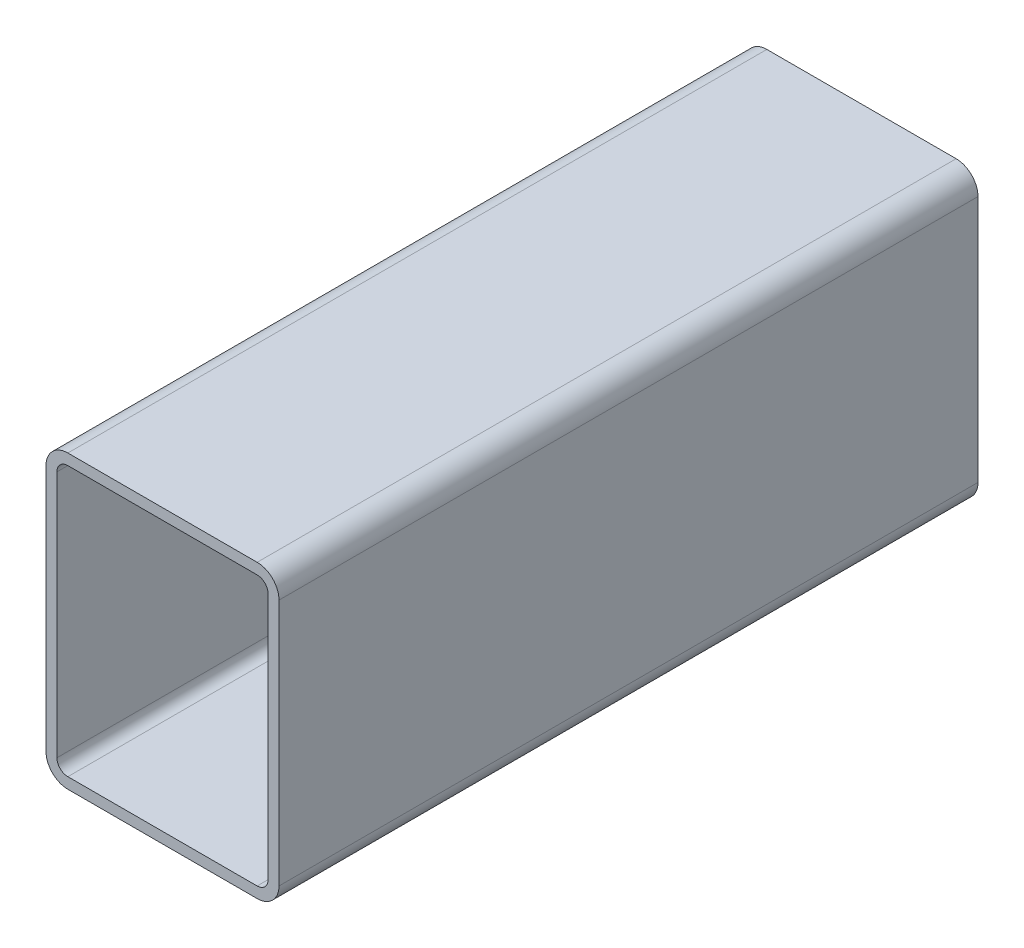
ISO-10303-21;
HEADER;
FILE_DESCRIPTION(('STEP AP214'),'2;1');
FILE_NAME('part.step','',(''),(''),'','','');
FILE_SCHEMA(('AUTOMOTIVE_DESIGN { 1 0 10303 214 1 1 1 1 }'));
ENDSEC;
DATA;
#1=APPLICATION_CONTEXT('core data for automotive mechanical design processes');
#2=APPLICATION_PROTOCOL_DEFINITION('international standard','automotive_design',2000,#1);
#3=PRODUCT_CONTEXT('',#1,'mechanical');
#4=PRODUCT('Part','Part','',(#3));
#5=PRODUCT_RELATED_PRODUCT_CATEGORY('part','',(#4));
#6=PRODUCT_DEFINITION_FORMATION('','',#4);
#7=PRODUCT_DEFINITION_CONTEXT('part definition',#1,'design');
#8=PRODUCT_DEFINITION('design','',#6,#7);
#9=PRODUCT_DEFINITION_SHAPE('','',#8);
#10=(LENGTH_UNIT() NAMED_UNIT(*) SI_UNIT(.MILLI.,.METRE.));
#11=(NAMED_UNIT(*) PLANE_ANGLE_UNIT() SI_UNIT($,.RADIAN.));
#12=(NAMED_UNIT(*) SI_UNIT($,.STERADIAN.) SOLID_ANGLE_UNIT());
#13=UNCERTAINTY_MEASURE_WITH_UNIT(LENGTH_MEASURE(1.E-05),#10,'distance_accuracy_value','');
#14=(GEOMETRIC_REPRESENTATION_CONTEXT(3) GLOBAL_UNCERTAINTY_ASSIGNED_CONTEXT((#13)) GLOBAL_UNIT_ASSIGNED_CONTEXT((#10,
#11,#12)) REPRESENTATION_CONTEXT('',''));
#15=CARTESIAN_POINT('',(0.,0.,0.));
#16=DIRECTION('',(0.,0.,1.));
#17=DIRECTION('',(1.,0.,0.));
#18=AXIS2_PLACEMENT_3D('',#15,#16,#17);
#19=CARTESIAN_POINT('',(11.2001778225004,119.50985662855,304.8));
#20=DIRECTION('',(0.,0.,1.));
#21=DIRECTION('',(1.,0.,0.));
#22=AXIS2_PLACEMENT_3D('',#19,#20,#21);
#23=PLANE('',#22);
#24=CARTESIAN_POINT('',(11.2001778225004,119.50985662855,304.8));
#25=DIRECTION('',(0.,0.,1.));
#26=DIRECTION('',(1.,0.,0.));
#27=AXIS2_PLACEMENT_3D('',#24,#25,#26);
#28=CIRCLE('',#27,9.525);
#29=CARTESIAN_POINT('',(11.2001778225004,129.03485662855,304.8));
#30=VERTEX_POINT('',#29);
#31=CARTESIAN_POINT('',(1.67517782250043,119.50985662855,304.8));
#32=VERTEX_POINT('',#31);
#33=EDGE_CURVE('E211',#30,#32,#28,.T.);
#34=ORIENTED_EDGE('',*,*,#33,.T.);
#35=DIRECTION('',(0.,-1.,0.));
#36=VECTOR('',#35,1.);
#37=CARTESIAN_POINT('',(1.67517782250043,11.5598566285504,304.8));
#38=LINE('',#37,#36);
#39=CARTESIAN_POINT('',(1.67517782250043,11.5598566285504,304.8));
#40=VERTEX_POINT('',#39);
#41=EDGE_CURVE('E214',#32,#40,#38,.T.);
#42=ORIENTED_EDGE('',*,*,#41,.T.);
#43=CARTESIAN_POINT('',(11.2001778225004,11.5598566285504,304.8));
#44=DIRECTION('',(0.,0.,1.));
#45=DIRECTION('',(1.,0.,0.));
#46=AXIS2_PLACEMENT_3D('',#43,#44,#45);
#47=CIRCLE('',#46,9.525);
#48=CARTESIAN_POINT('',(11.2001778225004,2.03485662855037,304.8));
#49=VERTEX_POINT('',#48);
#50=EDGE_CURVE('E217',#40,#49,#47,.T.);
#51=ORIENTED_EDGE('',*,*,#50,.T.);
#52=DIRECTION('',(1.,0.,0.));
#53=VECTOR('',#52,1.);
#54=CARTESIAN_POINT('',(93.7501778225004,2.03485662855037,304.8));
#55=LINE('',#54,#53);
#56=CARTESIAN_POINT('',(93.7501778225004,2.03485662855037,304.8));
#57=VERTEX_POINT('',#56);
#58=EDGE_CURVE('E219',#49,#57,#55,.T.);
#59=ORIENTED_EDGE('',*,*,#58,.T.);
#60=CARTESIAN_POINT('',(93.7501778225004,11.5598566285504,304.8));
#61=DIRECTION('',(0.,0.,1.));
#62=DIRECTION('',(1.,0.,0.));
#63=AXIS2_PLACEMENT_3D('',#60,#61,#62);
#64=CIRCLE('',#63,9.52500000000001);
#65=CARTESIAN_POINT('',(103.2751778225,11.5598566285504,304.8));
#66=VERTEX_POINT('',#65);
#67=EDGE_CURVE('E221',#57,#66,#64,.T.);
#68=ORIENTED_EDGE('',*,*,#67,.T.);
#69=DIRECTION('',(0.,1.,0.));
#70=VECTOR('',#69,1.);
#71=CARTESIAN_POINT('',(103.2751778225,119.50985662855,304.8));
#72=LINE('',#71,#70);
#73=CARTESIAN_POINT('',(103.2751778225,119.50985662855,304.8));
#74=VERTEX_POINT('',#73);
#75=EDGE_CURVE('E223',#66,#74,#72,.T.);
#76=ORIENTED_EDGE('',*,*,#75,.T.);
#77=CARTESIAN_POINT('',(93.7501778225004,119.50985662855,304.8));
#78=DIRECTION('',(0.,0.,1.));
#79=DIRECTION('',(1.,0.,0.));
#80=AXIS2_PLACEMENT_3D('',#77,#78,#79);
#81=CIRCLE('',#80,9.525);
#82=CARTESIAN_POINT('',(93.7501778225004,129.03485662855,304.8));
#83=VERTEX_POINT('',#82);
#84=EDGE_CURVE('E225',#74,#83,#81,.T.);
#85=ORIENTED_EDGE('',*,*,#84,.T.);
#86=DIRECTION('',(-1.,0.,0.));
#87=VECTOR('',#86,1.);
#88=CARTESIAN_POINT('',(11.2001778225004,129.03485662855,304.8));
#89=LINE('',#88,#87);
#90=EDGE_CURVE('E227',#83,#30,#89,.T.);
#91=ORIENTED_EDGE('',*,*,#90,.T.);
#92=EDGE_LOOP('',(#34,#42,#51,#59,#68,#76,#85,#91));
#93=FACE_BOUND('',#92,.T.);
#94=DIRECTION('',(0.,-1.,0.));
#95=VECTOR('',#94,1.);
#96=CARTESIAN_POINT('',(6.43767782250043,11.5598566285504,304.8));
#97=LINE('',#96,#95);
#98=CARTESIAN_POINT('',(6.43767782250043,119.50985662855,304.8));
#99=VERTEX_POINT('',#98);
#100=CARTESIAN_POINT('',(6.43767782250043,11.5598566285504,304.8));
#101=VERTEX_POINT('',#100);
#102=EDGE_CURVE('E154',#99,#101,#97,.T.);
#103=ORIENTED_EDGE('',*,*,#102,.F.);
#104=CARTESIAN_POINT('',(11.2001778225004,119.50985662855,304.8));
#105=DIRECTION('',(0.,0.,1.));
#106=DIRECTION('',(1.,0.,0.));
#107=AXIS2_PLACEMENT_3D('',#104,#105,#106);
#108=CIRCLE('',#107,4.7625);
#109=CARTESIAN_POINT('',(11.2001778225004,124.27235662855,304.8));
#110=VERTEX_POINT('',#109);
#111=EDGE_CURVE('E146',#110,#99,#108,.T.);
#112=ORIENTED_EDGE('',*,*,#111,.F.);
#113=DIRECTION('',(-1.,0.,0.));
#114=VECTOR('',#113,1.);
#115=CARTESIAN_POINT('',(11.2001778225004,124.27235662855,304.8));
#116=LINE('',#115,#114);
#117=CARTESIAN_POINT('',(93.7501778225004,124.27235662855,304.8));
#118=VERTEX_POINT('',#117);
#119=EDGE_CURVE('E179',#118,#110,#116,.T.);
#120=ORIENTED_EDGE('',*,*,#119,.F.);
#121=CARTESIAN_POINT('',(93.7501778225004,119.50985662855,304.8));
#122=DIRECTION('',(0.,0.,1.));
#123=DIRECTION('',(1.,0.,0.));
#124=AXIS2_PLACEMENT_3D('',#121,#122,#123);
#125=CIRCLE('',#124,4.7625);
#126=CARTESIAN_POINT('',(98.5126778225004,119.50985662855,304.8));
#127=VERTEX_POINT('',#126);
#128=EDGE_CURVE('E177',#127,#118,#125,.T.);
#129=ORIENTED_EDGE('',*,*,#128,.F.);
#130=DIRECTION('',(0.,1.,0.));
#131=VECTOR('',#130,1.);
#132=CARTESIAN_POINT('',(98.5126778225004,119.50985662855,304.8));
#133=LINE('',#132,#131);
#134=CARTESIAN_POINT('',(98.5126778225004,11.5598566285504,304.8));
#135=VERTEX_POINT('',#134);
#136=EDGE_CURVE('E175',#135,#127,#133,.T.);
#137=ORIENTED_EDGE('',*,*,#136,.F.);
#138=CARTESIAN_POINT('',(93.7501778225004,11.5598566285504,304.8));
#139=DIRECTION('',(0.,0.,1.));
#140=DIRECTION('',(1.,0.,0.));
#141=AXIS2_PLACEMENT_3D('',#138,#139,#140);
#142=CIRCLE('',#141,4.7625);
#143=CARTESIAN_POINT('',(93.7501778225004,6.79735662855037,304.8));
#144=VERTEX_POINT('',#143);
#145=EDGE_CURVE('E173',#144,#135,#142,.T.);
#146=ORIENTED_EDGE('',*,*,#145,.F.);
#147=DIRECTION('',(1.,0.,0.));
#148=VECTOR('',#147,1.);
#149=CARTESIAN_POINT('',(93.7501778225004,6.79735662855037,304.8));
#150=LINE('',#149,#148);
#151=CARTESIAN_POINT('',(11.2001778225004,6.79735662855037,304.8));
#152=VERTEX_POINT('',#151);
#153=EDGE_CURVE('E169',#152,#144,#150,.T.);
#154=ORIENTED_EDGE('',*,*,#153,.F.);
#155=CARTESIAN_POINT('',(11.2001778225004,11.5598566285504,304.8));
#156=DIRECTION('',(0.,0.,1.));
#157=DIRECTION('',(1.,0.,0.));
#158=AXIS2_PLACEMENT_3D('',#155,#156,#157);
#159=CIRCLE('',#158,4.7625);
#160=EDGE_CURVE('E167',#101,#152,#159,.T.);
#161=ORIENTED_EDGE('',*,*,#160,.F.);
#162=EDGE_LOOP('',(#103,#112,#120,#129,#137,#146,#154,#161));
#163=FACE_BOUND('',#162,.T.);
#164=ADVANCED_FACE('F33',(#93,#163),#23,.T.);
#165=CARTESIAN_POINT('',(11.2001778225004,119.50985662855,0.));
#166=DIRECTION('',(0.,0.,1.));
#167=DIRECTION('',(1.,0.,0.));
#168=AXIS2_PLACEMENT_3D('',#165,#166,#167);
#169=PLANE('',#168);
#170=CARTESIAN_POINT('',(11.2001778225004,119.50985662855,0.));
#171=DIRECTION('',(0.,0.,1.));
#172=DIRECTION('',(1.,0.,0.));
#173=AXIS2_PLACEMENT_3D('',#170,#171,#172);
#174=CIRCLE('',#173,9.525);
#175=CARTESIAN_POINT('',(11.2001778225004,129.03485662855,0.));
#176=VERTEX_POINT('',#175);
#177=CARTESIAN_POINT('',(1.67517782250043,119.50985662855,0.));
#178=VERTEX_POINT('',#177);
#179=EDGE_CURVE('E162',#176,#178,#174,.T.);
#180=ORIENTED_EDGE('',*,*,#179,.F.);
#181=DIRECTION('',(-1.,0.,0.));
#182=VECTOR('',#181,1.);
#183=CARTESIAN_POINT('',(11.2001778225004,129.03485662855,0.));
#184=LINE('',#183,#182);
#185=CARTESIAN_POINT('',(93.7501778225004,129.03485662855,0.));
#186=VERTEX_POINT('',#185);
#187=EDGE_CURVE('E215',#186,#176,#184,.T.);
#188=ORIENTED_EDGE('',*,*,#187,.F.);
#189=CARTESIAN_POINT('',(93.7501778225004,119.50985662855,0.));
#190=DIRECTION('',(0.,0.,1.));
#191=DIRECTION('',(1.,0.,0.));
#192=AXIS2_PLACEMENT_3D('',#189,#190,#191);
#193=CIRCLE('',#192,9.525);
#194=CARTESIAN_POINT('',(103.2751778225,119.50985662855,0.));
#195=VERTEX_POINT('',#194);
#196=EDGE_CURVE('E242',#195,#186,#193,.T.);
#197=ORIENTED_EDGE('',*,*,#196,.F.);
#198=DIRECTION('',(0.,1.,0.));
#199=VECTOR('',#198,1.);
#200=CARTESIAN_POINT('',(103.2751778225,119.50985662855,0.));
#201=LINE('',#200,#199);
#202=CARTESIAN_POINT('',(103.2751778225,11.5598566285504,0.));
#203=VERTEX_POINT('',#202);
#204=EDGE_CURVE('E240',#203,#195,#201,.T.);
#205=ORIENTED_EDGE('',*,*,#204,.F.);
#206=CARTESIAN_POINT('',(93.7501778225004,11.5598566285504,0.));
#207=DIRECTION('',(0.,0.,1.));
#208=DIRECTION('',(1.,0.,0.));
#209=AXIS2_PLACEMENT_3D('',#206,#207,#208);
#210=CIRCLE('',#209,9.52500000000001);
#211=CARTESIAN_POINT('',(93.7501778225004,2.03485662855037,0.));
#212=VERTEX_POINT('',#211);
#213=EDGE_CURVE('E238',#212,#203,#210,.T.);
#214=ORIENTED_EDGE('',*,*,#213,.F.);
#215=DIRECTION('',(1.,0.,0.));
#216=VECTOR('',#215,1.);
#217=CARTESIAN_POINT('',(93.7501778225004,2.03485662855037,0.));
#218=LINE('',#217,#216);
#219=CARTESIAN_POINT('',(11.2001778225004,2.03485662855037,0.));
#220=VERTEX_POINT('',#219);
#221=EDGE_CURVE('E236',#220,#212,#218,.T.);
#222=ORIENTED_EDGE('',*,*,#221,.F.);
#223=CARTESIAN_POINT('',(11.2001778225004,11.5598566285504,0.));
#224=DIRECTION('',(0.,0.,1.));
#225=DIRECTION('',(1.,0.,0.));
#226=AXIS2_PLACEMENT_3D('',#223,#224,#225);
#227=CIRCLE('',#226,9.525);
#228=CARTESIAN_POINT('',(1.67517782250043,11.5598566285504,0.));
#229=VERTEX_POINT('',#228);
#230=EDGE_CURVE('E234',#229,#220,#227,.T.);
#231=ORIENTED_EDGE('',*,*,#230,.F.);
#232=DIRECTION('',(0.,-1.,0.));
#233=VECTOR('',#232,1.);
#234=CARTESIAN_POINT('',(1.67517782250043,11.5598566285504,0.));
#235=LINE('',#234,#233);
#236=EDGE_CURVE('E232',#178,#229,#235,.T.);
#237=ORIENTED_EDGE('',*,*,#236,.F.);
#238=EDGE_LOOP('',(#180,#188,#197,#205,#214,#222,#231,#237));
#239=FACE_BOUND('',#238,.T.);
#240=CARTESIAN_POINT('',(11.2001778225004,119.50985662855,0.));
#241=DIRECTION('',(0.,0.,1.));
#242=DIRECTION('',(1.,0.,0.));
#243=AXIS2_PLACEMENT_3D('',#240,#241,#242);
#244=CIRCLE('',#243,4.7625);
#245=CARTESIAN_POINT('',(11.2001778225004,124.27235662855,0.));
#246=VERTEX_POINT('',#245);
#247=CARTESIAN_POINT('',(6.43767782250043,119.50985662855,0.));
#248=VERTEX_POINT('',#247);
#249=EDGE_CURVE('E56',#246,#248,#244,.T.);
#250=ORIENTED_EDGE('',*,*,#249,.T.);
#251=DIRECTION('',(0.,-1.,0.));
#252=VECTOR('',#251,1.);
#253=CARTESIAN_POINT('',(6.43767782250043,11.5598566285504,0.));
#254=LINE('',#253,#252);
#255=CARTESIAN_POINT('',(6.43767782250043,11.5598566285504,0.));
#256=VERTEX_POINT('',#255);
#257=EDGE_CURVE('E161',#248,#256,#254,.T.);
#258=ORIENTED_EDGE('',*,*,#257,.T.);
#259=CARTESIAN_POINT('',(11.2001778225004,11.5598566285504,0.));
#260=DIRECTION('',(0.,0.,1.));
#261=DIRECTION('',(1.,0.,0.));
#262=AXIS2_PLACEMENT_3D('',#259,#260,#261);
#263=CIRCLE('',#262,4.7625);
#264=CARTESIAN_POINT('',(11.2001778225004,6.79735662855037,0.));
#265=VERTEX_POINT('',#264);
#266=EDGE_CURVE('E183',#256,#265,#263,.T.);
#267=ORIENTED_EDGE('',*,*,#266,.T.);
#268=DIRECTION('',(1.,0.,0.));
#269=VECTOR('',#268,1.);
#270=CARTESIAN_POINT('',(93.7501778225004,6.79735662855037,0.));
#271=LINE('',#270,#269);
#272=CARTESIAN_POINT('',(93.7501778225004,6.79735662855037,0.));
#273=VERTEX_POINT('',#272);
#274=EDGE_CURVE('E186',#265,#273,#271,.T.);
#275=ORIENTED_EDGE('',*,*,#274,.T.);
#276=CARTESIAN_POINT('',(93.7501778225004,11.5598566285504,0.));
#277=DIRECTION('',(0.,0.,1.));
#278=DIRECTION('',(1.,0.,0.));
#279=AXIS2_PLACEMENT_3D('',#276,#277,#278);
#280=CIRCLE('',#279,4.7625);
#281=CARTESIAN_POINT('',(98.5126778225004,11.5598566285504,0.));
#282=VERTEX_POINT('',#281);
#283=EDGE_CURVE('E189',#273,#282,#280,.T.);
#284=ORIENTED_EDGE('',*,*,#283,.T.);
#285=DIRECTION('',(0.,1.,0.));
#286=VECTOR('',#285,1.);
#287=CARTESIAN_POINT('',(98.5126778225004,119.50985662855,0.));
#288=LINE('',#287,#286);
#289=CARTESIAN_POINT('',(98.5126778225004,119.50985662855,0.));
#290=VERTEX_POINT('',#289);
#291=EDGE_CURVE('E192',#282,#290,#288,.T.);
#292=ORIENTED_EDGE('',*,*,#291,.T.);
#293=CARTESIAN_POINT('',(93.7501778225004,119.50985662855,0.));
#294=DIRECTION('',(0.,0.,1.));
#295=DIRECTION('',(1.,0.,0.));
#296=AXIS2_PLACEMENT_3D('',#293,#294,#295);
#297=CIRCLE('',#296,4.7625);
#298=CARTESIAN_POINT('',(93.7501778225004,124.27235662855,0.));
#299=VERTEX_POINT('',#298);
#300=EDGE_CURVE('E195',#290,#299,#297,.T.);
#301=ORIENTED_EDGE('',*,*,#300,.T.);
#302=DIRECTION('',(-1.,0.,0.));
#303=VECTOR('',#302,1.);
#304=CARTESIAN_POINT('',(11.2001778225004,124.27235662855,0.));
#305=LINE('',#304,#303);
#306=EDGE_CURVE('E155',#299,#246,#305,.T.);
#307=ORIENTED_EDGE('',*,*,#306,.T.);
#308=EDGE_LOOP('',(#250,#258,#267,#275,#284,#292,#301,#307));
#309=FACE_BOUND('',#308,.T.);
#310=ADVANCED_FACE('F272',(#239,#309),#169,.F.);
#311=CARTESIAN_POINT('',(11.2001778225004,119.50985662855,304.8));
#312=DIRECTION('',(0.,0.,-1.));
#313=DIRECTION('',(-1.,0.,0.));
#314=AXIS2_PLACEMENT_3D('',#311,#312,#313);
#315=CYLINDRICAL_SURFACE('',#314,9.525);
#316=ORIENTED_EDGE('',*,*,#179,.T.);
#317=DIRECTION('',(0.,0.,-1.));
#318=VECTOR('',#317,1.);
#319=CARTESIAN_POINT('',(1.67517782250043,119.50985662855,304.8));
#320=LINE('',#319,#318);
#321=EDGE_CURVE('E11',#32,#178,#320,.T.);
#322=ORIENTED_EDGE('',*,*,#321,.F.);
#323=ORIENTED_EDGE('',*,*,#33,.F.);
#324=DIRECTION('',(0.,0.,-1.));
#325=VECTOR('',#324,1.);
#326=CARTESIAN_POINT('',(11.2001778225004,129.03485662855,304.8));
#327=LINE('',#326,#325);
#328=EDGE_CURVE('E229',#30,#176,#327,.T.);
#329=ORIENTED_EDGE('',*,*,#328,.T.);
#330=EDGE_LOOP('',(#316,#322,#323,#329));
#331=FACE_BOUND('',#330,.T.);
#332=ADVANCED_FACE('F35',(#331),#315,.T.);
#333=CARTESIAN_POINT('',(1.67517782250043,11.5598566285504,304.8));
#334=DIRECTION('',(1.,0.,0.));
#335=DIRECTION('',(0.,0.,-1.));
#336=AXIS2_PLACEMENT_3D('',#333,#334,#335);
#337=PLANE('',#336);
#338=ORIENTED_EDGE('',*,*,#236,.T.);
#339=DIRECTION('',(0.,0.,-1.));
#340=VECTOR('',#339,1.);
#341=CARTESIAN_POINT('',(1.67517782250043,11.5598566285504,304.8));
#342=LINE('',#341,#340);
#343=EDGE_CURVE('E41',#40,#229,#342,.T.);
#344=ORIENTED_EDGE('',*,*,#343,.F.);
#345=ORIENTED_EDGE('',*,*,#41,.F.);
#346=ORIENTED_EDGE('',*,*,#321,.T.);
#347=EDGE_LOOP('',(#338,#344,#345,#346));
#348=FACE_BOUND('',#347,.T.);
#349=ADVANCED_FACE('F289',(#348),#337,.F.);
#350=CARTESIAN_POINT('',(11.2001778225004,11.5598566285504,304.8));
#351=DIRECTION('',(0.,0.,-1.));
#352=DIRECTION('',(-1.,0.,0.));
#353=AXIS2_PLACEMENT_3D('',#350,#351,#352);
#354=CYLINDRICAL_SURFACE('',#353,9.525);
#355=ORIENTED_EDGE('',*,*,#230,.T.);
#356=DIRECTION('',(0.,0.,-1.));
#357=VECTOR('',#356,1.);
#358=CARTESIAN_POINT('',(11.2001778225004,2.03485662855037,304.8));
#359=LINE('',#358,#357);
#360=EDGE_CURVE('E259',#49,#220,#359,.T.);
#361=ORIENTED_EDGE('',*,*,#360,.F.);
#362=ORIENTED_EDGE('',*,*,#50,.F.);
#363=ORIENTED_EDGE('',*,*,#343,.T.);
#364=EDGE_LOOP('',(#355,#361,#362,#363));
#365=FACE_BOUND('',#364,.T.);
#366=ADVANCED_FACE('F266',(#365),#354,.T.);
#367=CARTESIAN_POINT('',(93.7501778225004,2.03485662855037,304.8));
#368=DIRECTION('',(0.,1.,0.));
#369=DIRECTION('',(0.,0.,1.));
#370=AXIS2_PLACEMENT_3D('',#367,#368,#369);
#371=PLANE('',#370);
#372=ORIENTED_EDGE('',*,*,#221,.T.);
#373=DIRECTION('',(0.,0.,-1.));
#374=VECTOR('',#373,1.);
#375=CARTESIAN_POINT('',(93.7501778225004,2.03485662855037,304.8));
#376=LINE('',#375,#374);
#377=EDGE_CURVE('E256',#57,#212,#376,.T.);
#378=ORIENTED_EDGE('',*,*,#377,.F.);
#379=ORIENTED_EDGE('',*,*,#58,.F.);
#380=ORIENTED_EDGE('',*,*,#360,.T.);
#381=EDGE_LOOP('',(#372,#378,#379,#380));
#382=FACE_BOUND('',#381,.T.);
#383=ADVANCED_FACE('F278',(#382),#371,.F.);
#384=CARTESIAN_POINT('',(93.7501778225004,11.5598566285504,304.8));
#385=DIRECTION('',(0.,0.,-1.));
#386=DIRECTION('',(-1.,0.,0.));
#387=AXIS2_PLACEMENT_3D('',#384,#385,#386);
#388=CYLINDRICAL_SURFACE('',#387,9.52500000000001);
#389=ORIENTED_EDGE('',*,*,#213,.T.);
#390=DIRECTION('',(0.,0.,-1.));
#391=VECTOR('',#390,1.);
#392=CARTESIAN_POINT('',(103.2751778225,11.5598566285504,304.8));
#393=LINE('',#392,#391);
#394=EDGE_CURVE('E253',#66,#203,#393,.T.);
#395=ORIENTED_EDGE('',*,*,#394,.F.);
#396=ORIENTED_EDGE('',*,*,#67,.F.);
#397=ORIENTED_EDGE('',*,*,#377,.T.);
#398=EDGE_LOOP('',(#389,#395,#396,#397));
#399=FACE_BOUND('',#398,.T.);
#400=ADVANCED_FACE('F282',(#399),#388,.T.);
#401=CARTESIAN_POINT('',(103.2751778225,119.50985662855,304.8));
#402=DIRECTION('',(-1.,0.,0.));
#403=DIRECTION('',(0.,0.,1.));
#404=AXIS2_PLACEMENT_3D('',#401,#402,#403);
#405=PLANE('',#404);
#406=ORIENTED_EDGE('',*,*,#204,.T.);
#407=DIRECTION('',(0.,0.,-1.));
#408=VECTOR('',#407,1.);
#409=CARTESIAN_POINT('',(103.2751778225,119.50985662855,304.8));
#410=LINE('',#409,#408);
#411=EDGE_CURVE('E250',#74,#195,#410,.T.);
#412=ORIENTED_EDGE('',*,*,#411,.F.);
#413=ORIENTED_EDGE('',*,*,#75,.F.);
#414=ORIENTED_EDGE('',*,*,#394,.T.);
#415=EDGE_LOOP('',(#406,#412,#413,#414));
#416=FACE_BOUND('',#415,.T.);
#417=ADVANCED_FACE('F302',(#416),#405,.F.);
#418=CARTESIAN_POINT('',(93.7501778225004,119.50985662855,304.8));
#419=DIRECTION('',(0.,0.,-1.));
#420=DIRECTION('',(-1.,0.,0.));
#421=AXIS2_PLACEMENT_3D('',#418,#419,#420);
#422=CYLINDRICAL_SURFACE('',#421,9.525);
#423=ORIENTED_EDGE('',*,*,#196,.T.);
#424=DIRECTION('',(0.,0.,-1.));
#425=VECTOR('',#424,1.);
#426=CARTESIAN_POINT('',(93.7501778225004,129.03485662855,304.8));
#427=LINE('',#426,#425);
#428=EDGE_CURVE('E247',#83,#186,#427,.T.);
#429=ORIENTED_EDGE('',*,*,#428,.F.);
#430=ORIENTED_EDGE('',*,*,#84,.F.);
#431=ORIENTED_EDGE('',*,*,#411,.T.);
#432=EDGE_LOOP('',(#423,#429,#430,#431));
#433=FACE_BOUND('',#432,.T.);
#434=ADVANCED_FACE('F300',(#433),#422,.T.);
#435=CARTESIAN_POINT('',(11.2001778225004,129.03485662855,304.8));
#436=DIRECTION('',(0.,-1.,0.));
#437=DIRECTION('',(0.,0.,-1.));
#438=AXIS2_PLACEMENT_3D('',#435,#436,#437);
#439=PLANE('',#438);
#440=ORIENTED_EDGE('',*,*,#187,.T.);
#441=ORIENTED_EDGE('',*,*,#328,.F.);
#442=ORIENTED_EDGE('',*,*,#90,.F.);
#443=ORIENTED_EDGE('',*,*,#428,.T.);
#444=EDGE_LOOP('',(#440,#441,#442,#443));
#445=FACE_BOUND('',#444,.T.);
#446=ADVANCED_FACE('F295',(#445),#439,.F.);
#447=CARTESIAN_POINT('',(11.2001778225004,119.50985662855,304.8));
#448=DIRECTION('',(0.,0.,-1.));
#449=DIRECTION('',(-1.,0.,0.));
#450=AXIS2_PLACEMENT_3D('',#447,#448,#449);
#451=CYLINDRICAL_SURFACE('',#450,4.7625);
#452=ORIENTED_EDGE('',*,*,#249,.F.);
#453=DIRECTION('',(0.,0.,-1.));
#454=VECTOR('',#453,1.);
#455=CARTESIAN_POINT('',(11.2001778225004,124.27235662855,304.8));
#456=LINE('',#455,#454);
#457=EDGE_CURVE('E150',#110,#246,#456,.T.);
#458=ORIENTED_EDGE('',*,*,#457,.F.);
#459=ORIENTED_EDGE('',*,*,#111,.T.);
#460=DIRECTION('',(0.,0.,-1.));
#461=VECTOR('',#460,1.);
#462=CARTESIAN_POINT('',(6.43767782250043,119.50985662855,304.8));
#463=LINE('',#462,#461);
#464=EDGE_CURVE('E149',#99,#248,#463,.T.);
#465=ORIENTED_EDGE('',*,*,#464,.T.);
#466=EDGE_LOOP('',(#452,#458,#459,#465));
#467=FACE_BOUND('',#466,.T.);
#468=ADVANCED_FACE('F148',(#467),#451,.F.);
#469=CARTESIAN_POINT('',(6.43767782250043,11.5598566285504,304.8));
#470=DIRECTION('',(1.,0.,0.));
#471=DIRECTION('',(0.,0.,-1.));
#472=AXIS2_PLACEMENT_3D('',#469,#470,#471);
#473=PLANE('',#472);
#474=ORIENTED_EDGE('',*,*,#257,.F.);
#475=ORIENTED_EDGE('',*,*,#464,.F.);
#476=ORIENTED_EDGE('',*,*,#102,.T.);
#477=DIRECTION('',(0.,0.,-1.));
#478=VECTOR('',#477,1.);
#479=CARTESIAN_POINT('',(6.43767782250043,11.5598566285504,304.8));
#480=LINE('',#479,#478);
#481=EDGE_CURVE('E163',#101,#256,#480,.T.);
#482=ORIENTED_EDGE('',*,*,#481,.T.);
#483=EDGE_LOOP('',(#474,#475,#476,#482));
#484=FACE_BOUND('',#483,.T.);
#485=ADVANCED_FACE('F158',(#484),#473,.T.);
#486=CARTESIAN_POINT('',(11.2001778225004,11.5598566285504,304.8));
#487=DIRECTION('',(0.,0.,-1.));
#488=DIRECTION('',(-1.,0.,0.));
#489=AXIS2_PLACEMENT_3D('',#486,#487,#488);
#490=CYLINDRICAL_SURFACE('',#489,4.7625);
#491=ORIENTED_EDGE('',*,*,#266,.F.);
#492=ORIENTED_EDGE('',*,*,#481,.F.);
#493=ORIENTED_EDGE('',*,*,#160,.T.);
#494=DIRECTION('',(0.,0.,-1.));
#495=VECTOR('',#494,1.);
#496=CARTESIAN_POINT('',(11.2001778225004,6.79735662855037,304.8));
#497=LINE('',#496,#495);
#498=EDGE_CURVE('E208',#152,#265,#497,.T.);
#499=ORIENTED_EDGE('',*,*,#498,.T.);
#500=EDGE_LOOP('',(#491,#492,#493,#499));
#501=FACE_BOUND('',#500,.T.);
#502=ADVANCED_FACE('F327',(#501),#490,.F.);
#503=CARTESIAN_POINT('',(93.7501778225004,6.79735662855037,304.8));
#504=DIRECTION('',(0.,1.,0.));
#505=DIRECTION('',(0.,0.,1.));
#506=AXIS2_PLACEMENT_3D('',#503,#504,#505);
#507=PLANE('',#506);
#508=ORIENTED_EDGE('',*,*,#274,.F.);
#509=ORIENTED_EDGE('',*,*,#498,.F.);
#510=ORIENTED_EDGE('',*,*,#153,.T.);
#511=DIRECTION('',(0.,0.,-1.));
#512=VECTOR('',#511,1.);
#513=CARTESIAN_POINT('',(93.7501778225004,6.79735662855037,304.8));
#514=LINE('',#513,#512);
#515=EDGE_CURVE('E206',#144,#273,#514,.T.);
#516=ORIENTED_EDGE('',*,*,#515,.T.);
#517=EDGE_LOOP('',(#508,#509,#510,#516));
#518=FACE_BOUND('',#517,.T.);
#519=ADVANCED_FACE('F331',(#518),#507,.T.);
#520=CARTESIAN_POINT('',(93.7501778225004,11.5598566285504,304.8));
#521=DIRECTION('',(0.,0.,-1.));
#522=DIRECTION('',(-1.,0.,0.));
#523=AXIS2_PLACEMENT_3D('',#520,#521,#522);
#524=CYLINDRICAL_SURFACE('',#523,4.7625);
#525=ORIENTED_EDGE('',*,*,#283,.F.);
#526=ORIENTED_EDGE('',*,*,#515,.F.);
#527=ORIENTED_EDGE('',*,*,#145,.T.);
#528=DIRECTION('',(0.,0.,-1.));
#529=VECTOR('',#528,1.);
#530=CARTESIAN_POINT('',(98.5126778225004,11.5598566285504,304.8));
#531=LINE('',#530,#529);
#532=EDGE_CURVE('E204',#135,#282,#531,.T.);
#533=ORIENTED_EDGE('',*,*,#532,.T.);
#534=EDGE_LOOP('',(#525,#526,#527,#533));
#535=FACE_BOUND('',#534,.T.);
#536=ADVANCED_FACE('F337',(#535),#524,.F.);
#537=CARTESIAN_POINT('',(98.5126778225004,119.50985662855,304.8));
#538=DIRECTION('',(-1.,0.,0.));
#539=DIRECTION('',(0.,0.,1.));
#540=AXIS2_PLACEMENT_3D('',#537,#538,#539);
#541=PLANE('',#540);
#542=ORIENTED_EDGE('',*,*,#291,.F.);
#543=ORIENTED_EDGE('',*,*,#532,.F.);
#544=ORIENTED_EDGE('',*,*,#136,.T.);
#545=DIRECTION('',(0.,0.,-1.));
#546=VECTOR('',#545,1.);
#547=CARTESIAN_POINT('',(98.5126778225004,119.50985662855,304.8));
#548=LINE('',#547,#546);
#549=EDGE_CURVE('E202',#127,#290,#548,.T.);
#550=ORIENTED_EDGE('',*,*,#549,.T.);
#551=EDGE_LOOP('',(#542,#543,#544,#550));
#552=FACE_BOUND('',#551,.T.);
#553=ADVANCED_FACE('F341',(#552),#541,.T.);
#554=CARTESIAN_POINT('',(93.7501778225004,119.50985662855,304.8));
#555=DIRECTION('',(0.,0.,-1.));
#556=DIRECTION('',(-1.,0.,0.));
#557=AXIS2_PLACEMENT_3D('',#554,#555,#556);
#558=CYLINDRICAL_SURFACE('',#557,4.7625);
#559=ORIENTED_EDGE('',*,*,#300,.F.);
#560=ORIENTED_EDGE('',*,*,#549,.F.);
#561=ORIENTED_EDGE('',*,*,#128,.T.);
#562=DIRECTION('',(0.,0.,-1.));
#563=VECTOR('',#562,1.);
#564=CARTESIAN_POINT('',(93.7501778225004,124.27235662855,304.8));
#565=LINE('',#564,#563);
#566=EDGE_CURVE('E48',#118,#299,#565,.T.);
#567=ORIENTED_EDGE('',*,*,#566,.T.);
#568=EDGE_LOOP('',(#559,#560,#561,#567));
#569=FACE_BOUND('',#568,.T.);
#570=ADVANCED_FACE('F345',(#569),#558,.F.);
#571=CARTESIAN_POINT('',(11.2001778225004,124.27235662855,304.8));
#572=DIRECTION('',(0.,-1.,0.));
#573=DIRECTION('',(0.,0.,-1.));
#574=AXIS2_PLACEMENT_3D('',#571,#572,#573);
#575=PLANE('',#574);
#576=ORIENTED_EDGE('',*,*,#306,.F.);
#577=ORIENTED_EDGE('',*,*,#566,.F.);
#578=ORIENTED_EDGE('',*,*,#119,.T.);
#579=ORIENTED_EDGE('',*,*,#457,.T.);
#580=EDGE_LOOP('',(#576,#577,#578,#579));
#581=FACE_BOUND('',#580,.T.);
#582=ADVANCED_FACE('F349',(#581),#575,.T.);
#583=CLOSED_SHELL('',(#164,#310,#332,#349,#366,#383,#400,#417,#434,#446,#468,#485,#502,#519,
#536,#553,#570,#582));
#584=MANIFOLD_SOLID_BREP('B2',#583);
#585=ADVANCED_BREP_SHAPE_REPRESENTATION('',(#18,#584),#14);
#586=SHAPE_DEFINITION_REPRESENTATION(#9,#585);
ENDSEC;
END-ISO-10303-21;
